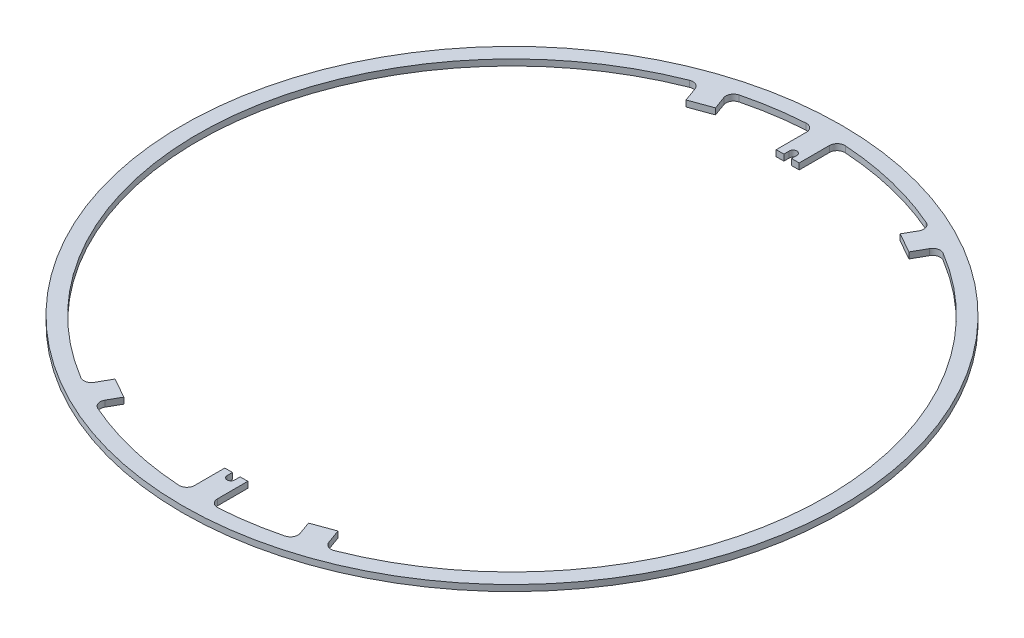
from build123d import *

# Parameters (mm, degrees)
SKETCH_1_R          = 43
SKETCH_1_R_2        = 41
EXTRUDE_1_DEPTH     = 0.8
EXTRUDE_START       = -0.8
EXTRUDE_2_DEPTH     = 0.8
FILLET_1_R          = 1
FILLET_2_R          = 1
CUT_EXTRUDE_1_DEPTH = 61.816445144
EXTRUDE_3_DEPTH     = 0.8
FILLET_3_R          = 1
EXTRUDE_4_DEPTH     = 0.8
FILLET_4_R          = 1


with BuildPart() as part:
    # Sketch 1 → Extrude 1 (new body)
    with BuildSketch(Plane(origin=(0, 0, 0), x_dir=(1, 0, 0), z_dir=(0, 1, 0))):
        with Locations(Location((0, 0, 0), (0, 0, 270))):
            Circle(SKETCH_1_R)
        with Locations(Location((0, 0, 0), (0, 0, 270))):
            Circle(SKETCH_1_R_2, mode=Mode.SUBTRACT)
    extrude(amount=EXTRUDE_1_DEPTH)

    # Sketch 2 → Extrude 2 (add)
    with BuildSketch(Plane(origin=(0, 0.8, 0), x_dir=(1, 0, 0), z_dir=(0, 1, 0)).offset(EXTRUDE_START)):
        with BuildLine():
            Line((-1.5, -35.972551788), (-1.5, -40.972551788))
            ThreePointArc((-1.5, -40.972551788), (0, -41), (1.5, -40.972551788))
            Line((1.5, -40.972551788), (1.5, -35.972551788))
            Line((1.5, -35.972551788), (-1.5, -35.972551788))
        make_face()
        with BuildLine():
            ThreePointArc((1.5, 40.972551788), (0, 41), (-1.5, 40.972551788))
            Line((-1.5, 40.972551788), (-1.5, 35.972551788))
            Line((-1.5, 35.972551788), (1.5, 35.972551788))
            Line((1.5, 35.972551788), (1.5, 40.972551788))
        make_face()
    extrude(amount=EXTRUDE_2_DEPTH)

    # Fillet 1
    fillet_1_edges = [part.edges().sort_by_distance(p)[0] for p in [
        (-1.5, 0.4, -40.972551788),
        (1.5, 0.4, -40.972551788),
    ]]
    fillet(fillet_1_edges, radius=FILLET_1_R)

    # Fillet 2
    fillet_2_edges = [part.edges().sort_by_distance(p)[0] for p in [
        (-1.5, 0.4, 40.972551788),
        (1.5, 0.4, 40.972551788),
    ]]
    fillet(fillet_2_edges, radius=FILLET_2_R)

    # Sketch 3 → Cut-Extrude 1 (cut, through all)
    with BuildSketch(Plane.XZ):
        with BuildLine():
            Line((-0.5, 36.672551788), (-0.5, 33.672551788))
            Line((-0.5, 33.672551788), (0.5, 33.672551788))
            Line((0.5, 33.672551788), (0.5, 36.672551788))
            ThreePointArc((0.5, 36.672551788), (0, 37.172551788), (-0.5, 36.672551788))
        make_face()
        with BuildLine():
            Line((0.5, -33.672551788), (0.5, -36.672551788))
            ThreePointArc((0.5, -36.672551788), (0, -37.172551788), (-0.5, -36.672551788))
            Line((-0.5, -36.672551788), (-0.5, -33.672551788))
            Line((-0.5, -33.672551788), (0.5, -33.672551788))
        make_face()
    extrude(amount=-CUT_EXTRUDE_1_DEPTH, mode=Mode.SUBTRACT)

    # Sketch 4 → Extrude 3 (add)
    with BuildSketch(Plane(origin=(0, 0.8, 0), x_dir=(1, 0, 0), z_dir=(0, 1, 0)).offset(EXTRUDE_START)):
        with BuildLine():
            Line((-20.189365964, -35.684583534), (-18.712095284, -33.073516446))
            Line((-18.712095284, -33.073516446), (-16.101028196, -34.550787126))
            Line((-16.101028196, -34.550787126), (-17.524179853, -37.066199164))
            ThreePointArc((-17.524179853, -37.066199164), (-18.869422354, -36.399792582), (-20.189365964, -35.684583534))
        make_face()
        with BuildLine():
            Line((20.189365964, 35.684583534), (18.712095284, 33.073516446))
            Line((18.712095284, 33.073516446), (16.101028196, 34.550787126))
            Line((16.101028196, 34.550787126), (17.524179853, 37.066199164))
            ThreePointArc((17.524179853, 37.066199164), (18.869422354, 36.399792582), (20.189365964, 35.684583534))
        make_face()
    extrude(amount=EXTRUDE_3_DEPTH)

    # Fillet 3
    fillet_3_edges = [part.edges().sort_by_distance(p)[0] for p in [
        (-17.524179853, 0.4, 37.066199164),
        (-20.189365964, 0.4, 35.684583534),
        (17.524179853, 0.4, -37.066199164),
        (20.189365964, 0.4, -35.684583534),
    ]]
    fillet(fillet_3_edges, radius=FILLET_3_R)

    # Sketch 5 → Extrude 4 (add)
    with BuildSketch(Plane.XZ):
        with BuildLine():
            Line((14.022825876, 38.527397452), (12.996765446, 35.70831959))
            Line((12.996765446, 35.70831959), (10.177687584, 36.73438002))
            Line((10.177687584, 36.73438002), (11.166158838, 39.450182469))
            ThreePointArc((11.166158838, 39.450182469), (12.602940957, 39.014944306), (14.022825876, 38.527397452))
        make_face()
        with BuildLine():
            Line((-12.996765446, -35.70831959), (-10.177687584, -36.73438002))
            Line((-10.177687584, -36.73438002), (-11.166158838, -39.450182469))
            ThreePointArc((-11.166158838, -39.450182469), (-12.602940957, -39.014944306), (-14.022825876, -38.527397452))
            Line((-14.022825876, -38.527397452), (-12.996765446, -35.70831959))
        make_face()
    extrude(amount=-EXTRUDE_4_DEPTH)

    # Fillet 4
    fillet_4_edges = [part.edges().sort_by_distance(p)[0] for p in [
        (14.022825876, 0.4, 38.527397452),
        (11.166158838, 0.4, 39.450182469),
        (-11.166158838, 0.4, -39.450182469),
        (-14.022825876, 0.4, -38.527397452),
    ]]
    fillet(fillet_4_edges, radius=FILLET_4_R)


solid = part.part
